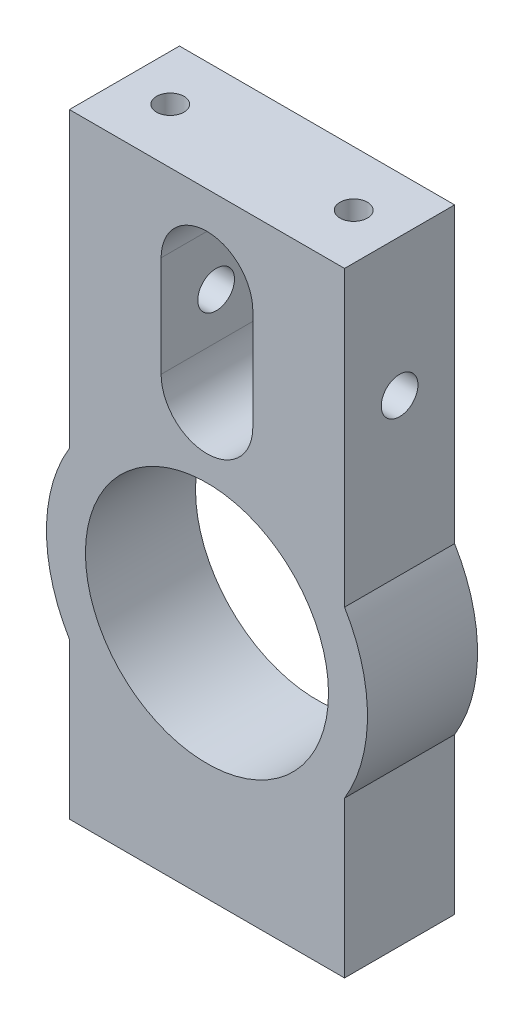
ISO-10303-21;
HEADER;
FILE_DESCRIPTION(('STEP AP214'),'2;1');
FILE_NAME('part.step','',(''),(''),'','','');
FILE_SCHEMA(('AUTOMOTIVE_DESIGN { 1 0 10303 214 1 1 1 1 }'));
ENDSEC;
DATA;
#1=APPLICATION_CONTEXT('core data for automotive mechanical design processes');
#2=APPLICATION_PROTOCOL_DEFINITION('international standard','automotive_design',2000,#1);
#3=PRODUCT_CONTEXT('',#1,'mechanical');
#4=PRODUCT('Part','Part','',(#3));
#5=PRODUCT_RELATED_PRODUCT_CATEGORY('part','',(#4));
#6=PRODUCT_DEFINITION_FORMATION('','',#4);
#7=PRODUCT_DEFINITION_CONTEXT('part definition',#1,'design');
#8=PRODUCT_DEFINITION('design','',#6,#7);
#9=PRODUCT_DEFINITION_SHAPE('','',#8);
#10=(LENGTH_UNIT() NAMED_UNIT(*) SI_UNIT(.MILLI.,.METRE.));
#11=(NAMED_UNIT(*) PLANE_ANGLE_UNIT() SI_UNIT($,.RADIAN.));
#12=(NAMED_UNIT(*) SI_UNIT($,.STERADIAN.) SOLID_ANGLE_UNIT());
#13=UNCERTAINTY_MEASURE_WITH_UNIT(LENGTH_MEASURE(1.E-05),#10,'distance_accuracy_value','');
#14=(GEOMETRIC_REPRESENTATION_CONTEXT(3) GLOBAL_UNCERTAINTY_ASSIGNED_CONTEXT((#13)) GLOBAL_UNIT_ASSIGNED_CONTEXT((#10,
#11,#12)) REPRESENTATION_CONTEXT('',''));
#15=CARTESIAN_POINT('',(0.,0.,0.));
#16=DIRECTION('',(0.,0.,1.));
#17=DIRECTION('',(1.,0.,0.));
#18=AXIS2_PLACEMENT_3D('',#15,#16,#17);
#19=CARTESIAN_POINT('',(0.,-14.,-6.));
#20=DIRECTION('',(0.,-1.,0.));
#21=DIRECTION('',(0.,0.,-1.));
#22=AXIS2_PLACEMENT_3D('',#19,#20,#21);
#23=PLANE('',#22);
#24=CARTESIAN_POINT('',(10.,-14.,0.));
#25=DIRECTION('',(0.,-1.,0.));
#26=DIRECTION('',(0.,0.,-1.));
#27=AXIS2_PLACEMENT_3D('',#24,#25,#26);
#28=CIRCLE('',#27,1.5);
#29=CARTESIAN_POINT('',(10.,-14.,-1.5));
#30=VERTEX_POINT('',#29);
#31=EDGE_CURVE('E20',#30,#30,#28,.T.);
#32=ORIENTED_EDGE('',*,*,#31,.T.);
#33=EDGE_LOOP('',(#32));
#34=FACE_BOUND('',#33,.T.);
#35=ADVANCED_FACE('F16',(#34),#23,.T.);
#36=CARTESIAN_POINT('',(0.,-14.,-6.));
#37=DIRECTION('',(0.,-1.,0.));
#38=DIRECTION('',(0.,0.,-1.));
#39=AXIS2_PLACEMENT_3D('',#36,#37,#38);
#40=PLANE('',#39);
#41=CARTESIAN_POINT('',(-10.,-14.,0.));
#42=DIRECTION('',(0.,-1.,0.));
#43=DIRECTION('',(0.,0.,-1.));
#44=AXIS2_PLACEMENT_3D('',#41,#42,#43);
#45=CIRCLE('',#44,1.5);
#46=CARTESIAN_POINT('',(-10.,-14.,-1.5));
#47=VERTEX_POINT('',#46);
#48=EDGE_CURVE('E275',#47,#47,#45,.T.);
#49=ORIENTED_EDGE('',*,*,#48,.T.);
#50=EDGE_LOOP('',(#49));
#51=FACE_BOUND('',#50,.T.);
#52=ADVANCED_FACE('F456',(#51),#40,.T.);
#53=CARTESIAN_POINT('',(0.,29.,-6.));
#54=DIRECTION('',(0.,1.,0.));
#55=DIRECTION('',(0.,0.,1.));
#56=AXIS2_PLACEMENT_3D('',#53,#54,#55);
#57=PLANE('',#56);
#58=CARTESIAN_POINT('',(10.,29.,0.));
#59=DIRECTION('',(0.,1.,0.));
#60=DIRECTION('',(0.,0.,1.));
#61=AXIS2_PLACEMENT_3D('',#58,#59,#60);
#62=CIRCLE('',#61,1.5);
#63=CARTESIAN_POINT('',(10.,29.,1.5));
#64=VERTEX_POINT('',#63);
#65=EDGE_CURVE('E273',#64,#64,#62,.T.);
#66=ORIENTED_EDGE('',*,*,#65,.T.);
#67=EDGE_LOOP('',(#66));
#68=FACE_BOUND('',#67,.T.);
#69=ADVANCED_FACE('F452',(#68),#57,.T.);
#70=CARTESIAN_POINT('',(0.,29.,-6.));
#71=DIRECTION('',(0.,1.,0.));
#72=DIRECTION('',(0.,0.,1.));
#73=AXIS2_PLACEMENT_3D('',#70,#71,#72);
#74=PLANE('',#73);
#75=CARTESIAN_POINT('',(-10.,29.,0.));
#76=DIRECTION('',(0.,1.,0.));
#77=DIRECTION('',(0.,0.,1.));
#78=AXIS2_PLACEMENT_3D('',#75,#76,#77);
#79=CIRCLE('',#78,1.5);
#80=CARTESIAN_POINT('',(-10.,29.,1.5));
#81=VERTEX_POINT('',#80);
#82=EDGE_CURVE('E227',#81,#81,#79,.T.);
#83=ORIENTED_EDGE('',*,*,#82,.T.);
#84=EDGE_LOOP('',(#83));
#85=FACE_BOUND('',#84,.T.);
#86=ADVANCED_FACE('F287',(#85),#74,.T.);
#87=CARTESIAN_POINT('',(10.,-26.,0.));
#88=DIRECTION('',(0.,-1.,0.));
#89=DIRECTION('',(0.,0.,-1.));
#90=AXIS2_PLACEMENT_3D('',#87,#88,#89);
#91=CYLINDRICAL_SURFACE('',#90,1.5);
#92=ORIENTED_EDGE('',*,*,#31,.F.);
#93=EDGE_LOOP('',(#92));
#94=FACE_BOUND('',#93,.T.);
#95=CARTESIAN_POINT('',(10.,-26.,0.));
#96=DIRECTION('',(0.,-1.,0.));
#97=DIRECTION('',(0.,0.,-1.));
#98=AXIS2_PLACEMENT_3D('',#95,#96,#97);
#99=CIRCLE('',#98,1.5);
#100=CARTESIAN_POINT('',(10.,-26.,-1.5));
#101=VERTEX_POINT('',#100);
#102=EDGE_CURVE('E200',#101,#101,#99,.F.);
#103=ORIENTED_EDGE('',*,*,#102,.F.);
#104=EDGE_LOOP('',(#103));
#105=FACE_BOUND('',#104,.T.);
#106=ADVANCED_FACE('F283',(#94,#105),#91,.F.);
#107=CARTESIAN_POINT('',(-10.,-26.,0.));
#108=DIRECTION('',(0.,-1.,0.));
#109=DIRECTION('',(0.,0.,-1.));
#110=AXIS2_PLACEMENT_3D('',#107,#108,#109);
#111=CYLINDRICAL_SURFACE('',#110,1.5);
#112=ORIENTED_EDGE('',*,*,#48,.F.);
#113=EDGE_LOOP('',(#112));
#114=FACE_BOUND('',#113,.T.);
#115=CARTESIAN_POINT('',(-10.,-26.,0.));
#116=DIRECTION('',(0.,-1.,0.));
#117=DIRECTION('',(0.,0.,-1.));
#118=AXIS2_PLACEMENT_3D('',#115,#116,#117);
#119=CIRCLE('',#118,1.5);
#120=CARTESIAN_POINT('',(-10.,-26.,-1.5));
#121=VERTEX_POINT('',#120);
#122=EDGE_CURVE('E231',#121,#121,#119,.F.);
#123=ORIENTED_EDGE('',*,*,#122,.F.);
#124=EDGE_LOOP('',(#123));
#125=FACE_BOUND('',#124,.T.);
#126=ADVANCED_FACE('F286',(#114,#125),#111,.F.);
#127=CARTESIAN_POINT('',(10.,41.,0.));
#128=DIRECTION('',(0.,1.,0.));
#129=DIRECTION('',(0.,0.,1.));
#130=AXIS2_PLACEMENT_3D('',#127,#128,#129);
#131=CYLINDRICAL_SURFACE('',#130,1.5);
#132=ORIENTED_EDGE('',*,*,#65,.F.);
#133=EDGE_LOOP('',(#132));
#134=FACE_BOUND('',#133,.T.);
#135=CARTESIAN_POINT('',(10.,41.,0.));
#136=DIRECTION('',(0.,1.,0.));
#137=DIRECTION('',(0.,0.,1.));
#138=AXIS2_PLACEMENT_3D('',#135,#136,#137);
#139=CIRCLE('',#138,1.5);
#140=CARTESIAN_POINT('',(10.,41.,1.5));
#141=VERTEX_POINT('',#140);
#142=EDGE_CURVE('E125',#141,#141,#139,.F.);
#143=ORIENTED_EDGE('',*,*,#142,.F.);
#144=EDGE_LOOP('',(#143));
#145=FACE_BOUND('',#144,.T.);
#146=ADVANCED_FACE('F439',(#134,#145),#131,.F.);
#147=CARTESIAN_POINT('',(-10.,41.,0.));
#148=DIRECTION('',(0.,1.,0.));
#149=DIRECTION('',(0.,0.,1.));
#150=AXIS2_PLACEMENT_3D('',#147,#148,#149);
#151=CYLINDRICAL_SURFACE('',#150,1.5);
#152=ORIENTED_EDGE('',*,*,#82,.F.);
#153=EDGE_LOOP('',(#152));
#154=FACE_BOUND('',#153,.T.);
#155=CARTESIAN_POINT('',(-10.,41.,0.));
#156=DIRECTION('',(0.,1.,0.));
#157=DIRECTION('',(0.,0.,1.));
#158=AXIS2_PLACEMENT_3D('',#155,#156,#157);
#159=CIRCLE('',#158,1.5);
#160=CARTESIAN_POINT('',(-10.,41.,1.5));
#161=VERTEX_POINT('',#160);
#162=EDGE_CURVE('E256',#161,#161,#159,.F.);
#163=ORIENTED_EDGE('',*,*,#162,.F.);
#164=EDGE_LOOP('',(#163));
#165=FACE_BOUND('',#164,.T.);
#166=ADVANCED_FACE('F434',(#154,#165),#151,.F.);
#167=CARTESIAN_POINT('',(-21.,26.,0.));
#168=DIRECTION('',(1.,0.,0.));
#169=DIRECTION('',(0.,0.,-1.));
#170=AXIS2_PLACEMENT_3D('',#167,#168,#169);
#171=CYLINDRICAL_SURFACE('',#170,2.);
#172=CARTESIAN_POINT('',(5.,26.,0.));
#173=DIRECTION('',(1.,0.,0.));
#174=DIRECTION('',(0.,0.,-1.));
#175=AXIS2_PLACEMENT_3D('',#172,#173,#174);
#176=CIRCLE('',#175,2.);
#177=CARTESIAN_POINT('',(5.,26.,-2.));
#178=VERTEX_POINT('',#177);
#179=EDGE_CURVE('E178',#178,#178,#176,.T.);
#180=ORIENTED_EDGE('',*,*,#179,.F.);
#181=EDGE_LOOP('',(#180));
#182=FACE_BOUND('',#181,.T.);
#183=CARTESIAN_POINT('',(15.,26.,0.));
#184=DIRECTION('',(1.,0.,0.));
#185=DIRECTION('',(0.,0.,-1.));
#186=AXIS2_PLACEMENT_3D('',#183,#184,#185);
#187=CIRCLE('',#186,2.);
#188=CARTESIAN_POINT('',(15.,26.,-2.));
#189=VERTEX_POINT('',#188);
#190=EDGE_CURVE('E179',#189,#189,#187,.F.);
#191=ORIENTED_EDGE('',*,*,#190,.F.);
#192=EDGE_LOOP('',(#191));
#193=FACE_BOUND('',#192,.T.);
#194=ADVANCED_FACE('F374',(#182,#193),#171,.F.);
#195=CARTESIAN_POINT('',(-21.,26.,0.));
#196=DIRECTION('',(1.,0.,0.));
#197=DIRECTION('',(0.,0.,-1.));
#198=AXIS2_PLACEMENT_3D('',#195,#196,#197);
#199=CYLINDRICAL_SURFACE('',#198,2.);
#200=CARTESIAN_POINT('',(-5.,26.,0.));
#201=DIRECTION('',(1.,0.,0.));
#202=DIRECTION('',(0.,0.,-1.));
#203=AXIS2_PLACEMENT_3D('',#200,#201,#202);
#204=CIRCLE('',#203,2.);
#205=CARTESIAN_POINT('',(-5.,26.,-2.));
#206=VERTEX_POINT('',#205);
#207=EDGE_CURVE('E170',#206,#206,#204,.F.);
#208=ORIENTED_EDGE('',*,*,#207,.F.);
#209=EDGE_LOOP('',(#208));
#210=FACE_BOUND('',#209,.T.);
#211=CARTESIAN_POINT('',(-15.,26.,0.));
#212=DIRECTION('',(1.,0.,0.));
#213=DIRECTION('',(0.,0.,-1.));
#214=AXIS2_PLACEMENT_3D('',#211,#212,#213);
#215=CIRCLE('',#214,2.);
#216=CARTESIAN_POINT('',(-15.,26.,-2.));
#217=VERTEX_POINT('',#216);
#218=EDGE_CURVE('E226',#217,#217,#215,.T.);
#219=ORIENTED_EDGE('',*,*,#218,.F.);
#220=EDGE_LOOP('',(#219));
#221=FACE_BOUND('',#220,.T.);
#222=ADVANCED_FACE('F366',(#210,#221),#199,.F.);
#223=CARTESIAN_POINT('',(0.,0.,6.));
#224=DIRECTION('',(0.,0.,1.));
#225=DIRECTION('',(1.,0.,0.));
#226=AXIS2_PLACEMENT_3D('',#223,#224,#225);
#227=PLANE('',#226);
#228=CARTESIAN_POINT('',(0.,32.,6.));
#229=DIRECTION('',(0.,0.,1.));
#230=DIRECTION('',(1.,0.,0.));
#231=AXIS2_PLACEMENT_3D('',#228,#229,#230);
#232=CIRCLE('',#231,5.);
#233=CARTESIAN_POINT('',(-5.,32.,6.));
#234=VERTEX_POINT('',#233);
#235=CARTESIAN_POINT('',(5.,32.,6.));
#236=VERTEX_POINT('',#235);
#237=EDGE_CURVE('E168',#234,#236,#232,.F.);
#238=ORIENTED_EDGE('',*,*,#237,.T.);
#239=DIRECTION('',(0.,1.,0.));
#240=VECTOR('',#239,1.);
#241=CARTESIAN_POINT('',(5.,32.,6.));
#242=LINE('',#241,#240);
#243=CARTESIAN_POINT('',(5.,21.,6.));
#244=VERTEX_POINT('',#243);
#245=EDGE_CURVE('E213',#244,#236,#242,.T.);
#246=ORIENTED_EDGE('',*,*,#245,.F.);
#247=CARTESIAN_POINT('',(0.,21.,6.));
#248=DIRECTION('',(0.,0.,1.));
#249=DIRECTION('',(1.,0.,0.));
#250=AXIS2_PLACEMENT_3D('',#247,#248,#249);
#251=CIRCLE('',#250,5.);
#252=CARTESIAN_POINT('',(-5.,21.,6.));
#253=VERTEX_POINT('',#252);
#254=EDGE_CURVE('E177',#244,#253,#251,.F.);
#255=ORIENTED_EDGE('',*,*,#254,.T.);
#256=DIRECTION('',(0.,1.,0.));
#257=VECTOR('',#256,1.);
#258=CARTESIAN_POINT('',(-5.,21.,6.));
#259=LINE('',#258,#257);
#260=EDGE_CURVE('E173',#234,#253,#259,.F.);
#261=ORIENTED_EDGE('',*,*,#260,.F.);
#262=EDGE_LOOP('',(#238,#246,#255,#261));
#263=FACE_BOUND('',#262,.T.);
#264=CARTESIAN_POINT('',(0.,0.,6.));
#265=DIRECTION('',(0.,0.,1.));
#266=DIRECTION('',(1.,0.,0.));
#267=AXIS2_PLACEMENT_3D('',#264,#265,#266);
#268=CIRCLE('',#267,13.25);
#269=CARTESIAN_POINT('',(13.25,0.,6.));
#270=VERTEX_POINT('',#269);
#271=EDGE_CURVE('E215',#270,#270,#268,.F.);
#272=ORIENTED_EDGE('',*,*,#271,.T.);
#273=EDGE_LOOP('',(#272));
#274=FACE_BOUND('',#273,.T.);
#275=DIRECTION('',(1.,0.,0.));
#276=VECTOR('',#275,1.);
#277=CARTESIAN_POINT('',(15.,41.,6.));
#278=LINE('',#277,#276);
#279=CARTESIAN_POINT('',(-15.,41.,6.));
#280=VERTEX_POINT('',#279);
#281=CARTESIAN_POINT('',(15.,41.,6.));
#282=VERTEX_POINT('',#281);
#283=EDGE_CURVE('E120',#280,#282,#278,.T.);
#284=ORIENTED_EDGE('',*,*,#283,.F.);
#285=DIRECTION('',(0.,1.,0.));
#286=VECTOR('',#285,1.);
#287=CARTESIAN_POINT('',(-15.,41.,6.));
#288=LINE('',#287,#286);
#289=CARTESIAN_POINT('',(-15.,9.01387818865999,6.));
#290=VERTEX_POINT('',#289);
#291=EDGE_CURVE('E223',#290,#280,#288,.T.);
#292=ORIENTED_EDGE('',*,*,#291,.F.);
#293=CARTESIAN_POINT('',(0.,0.,6.));
#294=DIRECTION('',(0.,0.,1.));
#295=DIRECTION('',(1.,0.,0.));
#296=AXIS2_PLACEMENT_3D('',#293,#294,#295);
#297=CIRCLE('',#296,17.5);
#298=CARTESIAN_POINT('',(-15.,-9.01387818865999,6.));
#299=VERTEX_POINT('',#298);
#300=EDGE_CURVE('E88',#299,#290,#297,.F.);
#301=ORIENTED_EDGE('',*,*,#300,.F.);
#302=DIRECTION('',(0.,1.,0.));
#303=VECTOR('',#302,1.);
#304=CARTESIAN_POINT('',(-15.,-9.01387818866,6.));
#305=LINE('',#304,#303);
#306=CARTESIAN_POINT('',(-15.,-26.,6.));
#307=VERTEX_POINT('',#306);
#308=EDGE_CURVE('E206',#307,#299,#305,.T.);
#309=ORIENTED_EDGE('',*,*,#308,.F.);
#310=DIRECTION('',(1.,0.,0.));
#311=VECTOR('',#310,1.);
#312=CARTESIAN_POINT('',(-15.,-26.,6.));
#313=LINE('',#312,#311);
#314=CARTESIAN_POINT('',(15.,-26.,6.));
#315=VERTEX_POINT('',#314);
#316=EDGE_CURVE('E99',#315,#307,#313,.F.);
#317=ORIENTED_EDGE('',*,*,#316,.F.);
#318=DIRECTION('',(0.,1.,0.));
#319=VECTOR('',#318,1.);
#320=CARTESIAN_POINT('',(15.,-26.,6.));
#321=LINE('',#320,#319);
#322=CARTESIAN_POINT('',(15.,-9.01387818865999,6.));
#323=VERTEX_POINT('',#322);
#324=EDGE_CURVE('E191',#323,#315,#321,.F.);
#325=ORIENTED_EDGE('',*,*,#324,.F.);
#326=CARTESIAN_POINT('',(0.,0.,6.));
#327=DIRECTION('',(0.,0.,1.));
#328=DIRECTION('',(1.,0.,0.));
#329=AXIS2_PLACEMENT_3D('',#326,#327,#328);
#330=CIRCLE('',#329,17.5);
#331=CARTESIAN_POINT('',(15.,9.01387818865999,6.));
#332=VERTEX_POINT('',#331);
#333=EDGE_CURVE('E188',#332,#323,#330,.F.);
#334=ORIENTED_EDGE('',*,*,#333,.F.);
#335=DIRECTION('',(0.,1.,0.));
#336=VECTOR('',#335,1.);
#337=CARTESIAN_POINT('',(15.,9.01387818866,6.));
#338=LINE('',#337,#336);
#339=EDGE_CURVE('E180',#282,#332,#338,.F.);
#340=ORIENTED_EDGE('',*,*,#339,.F.);
#341=EDGE_LOOP('',(#284,#292,#301,#309,#317,#325,#334,#340));
#342=FACE_BOUND('',#341,.T.);
#343=ADVANCED_FACE('F306',(#263,#274,#342),#227,.T.);
#344=CARTESIAN_POINT('',(-15.,41.,-6.));
#345=DIRECTION('',(-1.,0.,0.));
#346=DIRECTION('',(0.,0.,1.));
#347=AXIS2_PLACEMENT_3D('',#344,#345,#346);
#348=PLANE('',#347);
#349=ORIENTED_EDGE('',*,*,#218,.T.);
#350=EDGE_LOOP('',(#349));
#351=FACE_BOUND('',#350,.T.);
#352=DIRECTION('',(0.,0.,1.));
#353=VECTOR('',#352,1.);
#354=CARTESIAN_POINT('',(-15.,41.,-6.));
#355=LINE('',#354,#353);
#356=CARTESIAN_POINT('',(-15.,41.,-6.));
#357=VERTEX_POINT('',#356);
#358=EDGE_CURVE('E209',#357,#280,#355,.T.);
#359=ORIENTED_EDGE('',*,*,#358,.F.);
#360=DIRECTION('',(0.,1.,0.));
#361=VECTOR('',#360,1.);
#362=CARTESIAN_POINT('',(-15.,0.,-6.));
#363=LINE('',#362,#361);
#364=CARTESIAN_POINT('',(-15.,9.01387818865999,-6.));
#365=VERTEX_POINT('',#364);
#366=EDGE_CURVE('E133',#357,#365,#363,.F.);
#367=ORIENTED_EDGE('',*,*,#366,.T.);
#368=DIRECTION('',(0.,0.,1.));
#369=VECTOR('',#368,1.);
#370=CARTESIAN_POINT('',(-15.,9.01387818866,-6.));
#371=LINE('',#370,#369);
#372=EDGE_CURVE('E207',#290,#365,#371,.F.);
#373=ORIENTED_EDGE('',*,*,#372,.F.);
#374=ORIENTED_EDGE('',*,*,#291,.T.);
#375=EDGE_LOOP('',(#359,#367,#373,#374));
#376=FACE_BOUND('',#375,.T.);
#377=ADVANCED_FACE('F305',(#351,#376),#348,.T.);
#378=CARTESIAN_POINT('',(0.,0.,-6.));
#379=DIRECTION('',(0.,0.,1.));
#380=DIRECTION('',(1.,0.,0.));
#381=AXIS2_PLACEMENT_3D('',#378,#379,#380);
#382=CYLINDRICAL_SURFACE('',#381,17.5);
#383=CARTESIAN_POINT('',(0.,0.,-6.));
#384=DIRECTION('',(0.,0.,1.));
#385=DIRECTION('',(1.,0.,0.));
#386=AXIS2_PLACEMENT_3D('',#383,#384,#385);
#387=CIRCLE('',#386,17.5);
#388=CARTESIAN_POINT('',(-15.,-9.01387818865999,-6.));
#389=VERTEX_POINT('',#388);
#390=EDGE_CURVE('E159',#365,#389,#387,.T.);
#391=ORIENTED_EDGE('',*,*,#390,.T.);
#392=DIRECTION('',(0.,0.,1.));
#393=VECTOR('',#392,1.);
#394=CARTESIAN_POINT('',(-15.,-9.01387818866,-6.));
#395=LINE('',#394,#393);
#396=EDGE_CURVE('E203',#299,#389,#395,.F.);
#397=ORIENTED_EDGE('',*,*,#396,.F.);
#398=ORIENTED_EDGE('',*,*,#300,.T.);
#399=ORIENTED_EDGE('',*,*,#372,.T.);
#400=EDGE_LOOP('',(#391,#397,#398,#399));
#401=FACE_BOUND('',#400,.T.);
#402=ADVANCED_FACE('F302',(#401),#382,.T.);
#403=CARTESIAN_POINT('',(-15.,-9.01387818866,-6.));
#404=DIRECTION('',(-1.,0.,0.));
#405=DIRECTION('',(0.,0.,1.));
#406=AXIS2_PLACEMENT_3D('',#403,#404,#405);
#407=PLANE('',#406);
#408=ORIENTED_EDGE('',*,*,#396,.T.);
#409=DIRECTION('',(0.,1.,0.));
#410=VECTOR('',#409,1.);
#411=CARTESIAN_POINT('',(-15.,0.,-6.));
#412=LINE('',#411,#410);
#413=CARTESIAN_POINT('',(-15.,-26.,-6.));
#414=VERTEX_POINT('',#413);
#415=EDGE_CURVE('E156',#389,#414,#412,.F.);
#416=ORIENTED_EDGE('',*,*,#415,.T.);
#417=DIRECTION('',(0.,0.,-1.));
#418=VECTOR('',#417,1.);
#419=CARTESIAN_POINT('',(-15.,-26.,-6.));
#420=LINE('',#419,#418);
#421=EDGE_CURVE('E198',#307,#414,#420,.T.);
#422=ORIENTED_EDGE('',*,*,#421,.F.);
#423=ORIENTED_EDGE('',*,*,#308,.T.);
#424=EDGE_LOOP('',(#408,#416,#422,#423));
#425=FACE_BOUND('',#424,.T.);
#426=ADVANCED_FACE('F294',(#425),#407,.T.);
#427=CARTESIAN_POINT('',(-15.,-26.,-6.));
#428=DIRECTION('',(0.,-1.,0.));
#429=DIRECTION('',(0.,0.,-1.));
#430=AXIS2_PLACEMENT_3D('',#427,#428,#429);
#431=PLANE('',#430);
#432=ORIENTED_EDGE('',*,*,#122,.T.);
#433=EDGE_LOOP('',(#432));
#434=FACE_BOUND('',#433,.T.);
#435=ORIENTED_EDGE('',*,*,#102,.T.);
#436=EDGE_LOOP('',(#435));
#437=FACE_BOUND('',#436,.T.);
#438=ORIENTED_EDGE('',*,*,#421,.T.);
#439=DIRECTION('',(1.,0.,0.));
#440=VECTOR('',#439,1.);
#441=CARTESIAN_POINT('',(0.,-26.,-6.));
#442=LINE('',#441,#440);
#443=CARTESIAN_POINT('',(15.,-26.,-6.));
#444=VERTEX_POINT('',#443);
#445=EDGE_CURVE('E153',#414,#444,#442,.T.);
#446=ORIENTED_EDGE('',*,*,#445,.T.);
#447=DIRECTION('',(0.,0.,-1.));
#448=VECTOR('',#447,1.);
#449=CARTESIAN_POINT('',(15.,-26.,-6.));
#450=LINE('',#449,#448);
#451=EDGE_CURVE('E189',#315,#444,#450,.T.);
#452=ORIENTED_EDGE('',*,*,#451,.F.);
#453=ORIENTED_EDGE('',*,*,#316,.T.);
#454=EDGE_LOOP('',(#438,#446,#452,#453));
#455=FACE_BOUND('',#454,.T.);
#456=ADVANCED_FACE('F291',(#434,#437,#455),#431,.T.);
#457=CARTESIAN_POINT('',(15.,-26.,-6.));
#458=DIRECTION('',(1.,0.,0.));
#459=DIRECTION('',(0.,0.,-1.));
#460=AXIS2_PLACEMENT_3D('',#457,#458,#459);
#461=PLANE('',#460);
#462=ORIENTED_EDGE('',*,*,#451,.T.);
#463=DIRECTION('',(0.,1.,0.));
#464=VECTOR('',#463,1.);
#465=CARTESIAN_POINT('',(15.,0.,-6.));
#466=LINE('',#465,#464);
#467=CARTESIAN_POINT('',(15.,-9.01387818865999,-6.));
#468=VERTEX_POINT('',#467);
#469=EDGE_CURVE('E143',#444,#468,#466,.T.);
#470=ORIENTED_EDGE('',*,*,#469,.T.);
#471=DIRECTION('',(0.,0.,1.));
#472=VECTOR('',#471,1.);
#473=CARTESIAN_POINT('',(15.,-9.01387818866,-6.));
#474=LINE('',#473,#472);
#475=EDGE_CURVE('E186',#323,#468,#474,.F.);
#476=ORIENTED_EDGE('',*,*,#475,.F.);
#477=ORIENTED_EDGE('',*,*,#324,.T.);
#478=EDGE_LOOP('',(#462,#470,#476,#477));
#479=FACE_BOUND('',#478,.T.);
#480=ADVANCED_FACE('F293',(#479),#461,.T.);
#481=CARTESIAN_POINT('',(0.,0.,-6.));
#482=DIRECTION('',(0.,0.,1.));
#483=DIRECTION('',(1.,0.,0.));
#484=AXIS2_PLACEMENT_3D('',#481,#482,#483);
#485=CYLINDRICAL_SURFACE('',#484,17.5);
#486=CARTESIAN_POINT('',(0.,0.,-6.));
#487=DIRECTION('',(0.,0.,1.));
#488=DIRECTION('',(1.,0.,0.));
#489=AXIS2_PLACEMENT_3D('',#486,#487,#488);
#490=CIRCLE('',#489,17.5);
#491=CARTESIAN_POINT('',(15.,9.01387818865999,-6.));
#492=VERTEX_POINT('',#491);
#493=EDGE_CURVE('E141',#468,#492,#490,.T.);
#494=ORIENTED_EDGE('',*,*,#493,.T.);
#495=DIRECTION('',(0.,0.,-1.));
#496=VECTOR('',#495,1.);
#497=CARTESIAN_POINT('',(15.,9.01387818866,-6.));
#498=LINE('',#497,#496);
#499=EDGE_CURVE('E140',#332,#492,#498,.T.);
#500=ORIENTED_EDGE('',*,*,#499,.F.);
#501=ORIENTED_EDGE('',*,*,#333,.T.);
#502=ORIENTED_EDGE('',*,*,#475,.T.);
#503=EDGE_LOOP('',(#494,#500,#501,#502));
#504=FACE_BOUND('',#503,.T.);
#505=ADVANCED_FACE('F309',(#504),#485,.T.);
#506=CARTESIAN_POINT('',(15.,9.01387818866,-6.));
#507=DIRECTION('',(1.,0.,0.));
#508=DIRECTION('',(0.,0.,-1.));
#509=AXIS2_PLACEMENT_3D('',#506,#507,#508);
#510=PLANE('',#509);
#511=ORIENTED_EDGE('',*,*,#190,.T.);
#512=EDGE_LOOP('',(#511));
#513=FACE_BOUND('',#512,.T.);
#514=ORIENTED_EDGE('',*,*,#499,.T.);
#515=DIRECTION('',(0.,1.,0.));
#516=VECTOR('',#515,1.);
#517=CARTESIAN_POINT('',(15.,0.,-6.));
#518=LINE('',#517,#516);
#519=CARTESIAN_POINT('',(15.,41.,-6.));
#520=VERTEX_POINT('',#519);
#521=EDGE_CURVE('E130',#492,#520,#518,.T.);
#522=ORIENTED_EDGE('',*,*,#521,.T.);
#523=DIRECTION('',(0.,0.,1.));
#524=VECTOR('',#523,1.);
#525=CARTESIAN_POINT('',(15.,41.,-6.));
#526=LINE('',#525,#524);
#527=EDGE_CURVE('E114',#282,#520,#526,.F.);
#528=ORIENTED_EDGE('',*,*,#527,.F.);
#529=ORIENTED_EDGE('',*,*,#339,.T.);
#530=EDGE_LOOP('',(#514,#522,#528,#529));
#531=FACE_BOUND('',#530,.T.);
#532=ADVANCED_FACE('F138',(#513,#531),#510,.T.);
#533=CARTESIAN_POINT('',(15.,41.,-6.));
#534=DIRECTION('',(0.,1.,0.));
#535=DIRECTION('',(0.,0.,1.));
#536=AXIS2_PLACEMENT_3D('',#533,#534,#535);
#537=PLANE('',#536);
#538=ORIENTED_EDGE('',*,*,#162,.T.);
#539=EDGE_LOOP('',(#538));
#540=FACE_BOUND('',#539,.T.);
#541=ORIENTED_EDGE('',*,*,#142,.T.);
#542=EDGE_LOOP('',(#541));
#543=FACE_BOUND('',#542,.T.);
#544=ORIENTED_EDGE('',*,*,#527,.T.);
#545=DIRECTION('',(1.,0.,0.));
#546=VECTOR('',#545,1.);
#547=CARTESIAN_POINT('',(0.,41.,-6.));
#548=LINE('',#547,#546);
#549=EDGE_CURVE('E118',#520,#357,#548,.F.);
#550=ORIENTED_EDGE('',*,*,#549,.T.);
#551=ORIENTED_EDGE('',*,*,#358,.T.);
#552=ORIENTED_EDGE('',*,*,#283,.T.);
#553=EDGE_LOOP('',(#544,#550,#551,#552));
#554=FACE_BOUND('',#553,.T.);
#555=ADVANCED_FACE('F116',(#540,#543,#554),#537,.T.);
#556=CARTESIAN_POINT('',(0.,0.,-6.));
#557=DIRECTION('',(0.,0.,1.));
#558=DIRECTION('',(1.,0.,0.));
#559=AXIS2_PLACEMENT_3D('',#556,#557,#558);
#560=CYLINDRICAL_SURFACE('',#559,13.25);
#561=ORIENTED_EDGE('',*,*,#271,.F.);
#562=EDGE_LOOP('',(#561));
#563=FACE_BOUND('',#562,.T.);
#564=CARTESIAN_POINT('',(0.,0.,-6.));
#565=DIRECTION('',(0.,0.,1.));
#566=DIRECTION('',(1.,0.,0.));
#567=AXIS2_PLACEMENT_3D('',#564,#565,#566);
#568=CIRCLE('',#567,13.25);
#569=CARTESIAN_POINT('',(13.25,0.,-6.));
#570=VERTEX_POINT('',#569);
#571=EDGE_CURVE('E135',#570,#570,#568,.F.);
#572=ORIENTED_EDGE('',*,*,#571,.T.);
#573=EDGE_LOOP('',(#572));
#574=FACE_BOUND('',#573,.T.);
#575=ADVANCED_FACE('F332',(#563,#574),#560,.F.);
#576=CARTESIAN_POINT('',(5.,32.,-6.));
#577=DIRECTION('',(-1.,0.,0.));
#578=DIRECTION('',(0.,0.,1.));
#579=AXIS2_PLACEMENT_3D('',#576,#577,#578);
#580=PLANE('',#579);
#581=ORIENTED_EDGE('',*,*,#179,.T.);
#582=EDGE_LOOP('',(#581));
#583=FACE_BOUND('',#582,.T.);
#584=DIRECTION('',(0.,0.,1.));
#585=VECTOR('',#584,1.);
#586=CARTESIAN_POINT('',(5.,32.,-6.));
#587=LINE('',#586,#585);
#588=CARTESIAN_POINT('',(5.,32.,-6.));
#589=VERTEX_POINT('',#588);
#590=EDGE_CURVE('E163',#236,#589,#587,.F.);
#591=ORIENTED_EDGE('',*,*,#590,.T.);
#592=DIRECTION('',(0.,1.,0.));
#593=VECTOR('',#592,1.);
#594=CARTESIAN_POINT('',(5.,0.,-6.));
#595=LINE('',#594,#593);
#596=CARTESIAN_POINT('',(5.,21.,-6.));
#597=VERTEX_POINT('',#596);
#598=EDGE_CURVE('E147',#589,#597,#595,.F.);
#599=ORIENTED_EDGE('',*,*,#598,.T.);
#600=DIRECTION('',(0.,0.,1.));
#601=VECTOR('',#600,1.);
#602=CARTESIAN_POINT('',(5.,21.,-6.));
#603=LINE('',#602,#601);
#604=EDGE_CURVE('E174',#597,#244,#603,.T.);
#605=ORIENTED_EDGE('',*,*,#604,.T.);
#606=ORIENTED_EDGE('',*,*,#245,.T.);
#607=EDGE_LOOP('',(#591,#599,#605,#606));
#608=FACE_BOUND('',#607,.T.);
#609=ADVANCED_FACE('F334',(#583,#608),#580,.T.);
#610=CARTESIAN_POINT('',(0.,21.,-6.));
#611=DIRECTION('',(0.,0.,1.));
#612=DIRECTION('',(1.,0.,0.));
#613=AXIS2_PLACEMENT_3D('',#610,#611,#612);
#614=CYLINDRICAL_SURFACE('',#613,5.);
#615=ORIENTED_EDGE('',*,*,#254,.F.);
#616=ORIENTED_EDGE('',*,*,#604,.F.);
#617=CARTESIAN_POINT('',(0.,21.,-6.));
#618=DIRECTION('',(0.,0.,1.));
#619=DIRECTION('',(1.,0.,0.));
#620=AXIS2_PLACEMENT_3D('',#617,#618,#619);
#621=CIRCLE('',#620,5.);
#622=CARTESIAN_POINT('',(-5.,21.,-6.));
#623=VERTEX_POINT('',#622);
#624=EDGE_CURVE('E240',#597,#623,#621,.F.);
#625=ORIENTED_EDGE('',*,*,#624,.T.);
#626=DIRECTION('',(0.,0.,-1.));
#627=VECTOR('',#626,1.);
#628=CARTESIAN_POINT('',(-5.,21.,-6.));
#629=LINE('',#628,#627);
#630=EDGE_CURVE('E171',#253,#623,#629,.T.);
#631=ORIENTED_EDGE('',*,*,#630,.F.);
#632=EDGE_LOOP('',(#615,#616,#625,#631));
#633=FACE_BOUND('',#632,.T.);
#634=ADVANCED_FACE('F341',(#633),#614,.F.);
#635=CARTESIAN_POINT('',(-5.,21.,-6.));
#636=DIRECTION('',(1.,0.,0.));
#637=DIRECTION('',(0.,0.,-1.));
#638=AXIS2_PLACEMENT_3D('',#635,#636,#637);
#639=PLANE('',#638);
#640=ORIENTED_EDGE('',*,*,#207,.T.);
#641=EDGE_LOOP('',(#640));
#642=FACE_BOUND('',#641,.T.);
#643=ORIENTED_EDGE('',*,*,#630,.T.);
#644=DIRECTION('',(0.,1.,0.));
#645=VECTOR('',#644,1.);
#646=CARTESIAN_POINT('',(-5.,0.,-6.));
#647=LINE('',#646,#645);
#648=CARTESIAN_POINT('',(-5.,32.,-6.));
#649=VERTEX_POINT('',#648);
#650=EDGE_CURVE('E26',#623,#649,#647,.T.);
#651=ORIENTED_EDGE('',*,*,#650,.T.);
#652=DIRECTION('',(0.,0.,1.));
#653=VECTOR('',#652,1.);
#654=CARTESIAN_POINT('',(-5.,32.,-6.));
#655=LINE('',#654,#653);
#656=EDGE_CURVE('E34',#649,#234,#655,.T.);
#657=ORIENTED_EDGE('',*,*,#656,.T.);
#658=ORIENTED_EDGE('',*,*,#260,.T.);
#659=EDGE_LOOP('',(#643,#651,#657,#658));
#660=FACE_BOUND('',#659,.T.);
#661=ADVANCED_FACE('F325',(#642,#660),#639,.T.);
#662=CARTESIAN_POINT('',(0.,32.,-6.));
#663=DIRECTION('',(0.,0.,1.));
#664=DIRECTION('',(1.,0.,0.));
#665=AXIS2_PLACEMENT_3D('',#662,#663,#664);
#666=CYLINDRICAL_SURFACE('',#665,5.);
#667=ORIENTED_EDGE('',*,*,#237,.F.);
#668=ORIENTED_EDGE('',*,*,#656,.F.);
#669=CARTESIAN_POINT('',(0.,32.,-6.));
#670=DIRECTION('',(0.,0.,1.));
#671=DIRECTION('',(1.,0.,0.));
#672=AXIS2_PLACEMENT_3D('',#669,#670,#671);
#673=CIRCLE('',#672,5.);
#674=EDGE_CURVE('E11',#649,#589,#673,.F.);
#675=ORIENTED_EDGE('',*,*,#674,.T.);
#676=ORIENTED_EDGE('',*,*,#590,.F.);
#677=EDGE_LOOP('',(#667,#668,#675,#676));
#678=FACE_BOUND('',#677,.T.);
#679=ADVANCED_FACE('F320',(#678),#666,.F.);
#680=CARTESIAN_POINT('',(0.,0.,-6.));
#681=DIRECTION('',(0.,0.,1.));
#682=DIRECTION('',(1.,0.,0.));
#683=AXIS2_PLACEMENT_3D('',#680,#681,#682);
#684=PLANE('',#683);
#685=ORIENTED_EDGE('',*,*,#650,.F.);
#686=ORIENTED_EDGE('',*,*,#624,.F.);
#687=ORIENTED_EDGE('',*,*,#598,.F.);
#688=ORIENTED_EDGE('',*,*,#674,.F.);
#689=EDGE_LOOP('',(#685,#686,#687,#688));
#690=FACE_BOUND('',#689,.T.);
#691=ORIENTED_EDGE('',*,*,#571,.F.);
#692=EDGE_LOOP('',(#691));
#693=FACE_BOUND('',#692,.T.);
#694=ORIENTED_EDGE('',*,*,#521,.F.);
#695=ORIENTED_EDGE('',*,*,#493,.F.);
#696=ORIENTED_EDGE('',*,*,#469,.F.);
#697=ORIENTED_EDGE('',*,*,#445,.F.);
#698=ORIENTED_EDGE('',*,*,#415,.F.);
#699=ORIENTED_EDGE('',*,*,#390,.F.);
#700=ORIENTED_EDGE('',*,*,#366,.F.);
#701=ORIENTED_EDGE('',*,*,#549,.F.);
#702=EDGE_LOOP('',(#694,#695,#696,#697,#698,#699,#700,#701));
#703=FACE_BOUND('',#702,.T.);
#704=ADVANCED_FACE('F18',(#690,#693,#703),#684,.F.);
#705=CLOSED_SHELL('',(#35,#52,#69,#86,#106,#126,#146,#166,#194,#222,#343,#377,#402,#426,#456,
#480,#505,#532,#555,#575,#609,#634,#661,#679,#704));
#706=MANIFOLD_SOLID_BREP('B1',#705);
#707=ADVANCED_BREP_SHAPE_REPRESENTATION('',(#18,#706),#14);
#708=SHAPE_DEFINITION_REPRESENTATION(#9,#707);
ENDSEC;
END-ISO-10303-21;
